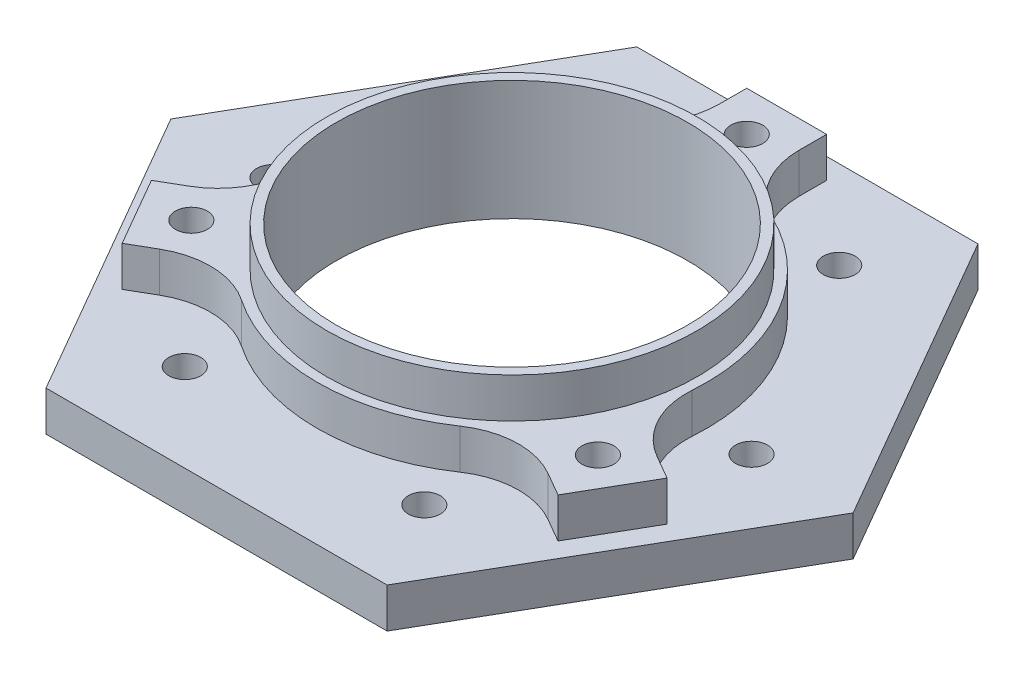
from build123d import *

# Parameters (mm, degrees)
SKETCH_1_R      = 22
SKETCH_1_R_2    = 2
EXTRUDE_1_DEPTH = 5
SKETCH_3_R      = 24.4
SKETCH_3_R_2    = 22
EXTRUDE_2_DEPTH = 5
SKETCH_4_R      = 23.2
SKETCH_4_R_2    = 22
EXTRUDE_3_DEPTH = 5
SKETCH_5_R      = 2
EXTRUDE_4_DEPTH = 5
FILLET_1_R      = 10


with BuildPart() as part:
    # Sketch 1 → Extrude 1 (new body)
    with BuildSketch(Plane(origin=(0, 0, 0), x_dir=(1, 0, 0), z_dir=(0, 1, 0))):
        Polygon((42.72391992, 0), (21.36195996, 37), (-21.36195996, 37), (-42.72391992, 0), (-21.36195996, -37), (21.36195996, -37), align=None)
        with Locations(Location((0, 0, 0), (0, 0, 270))):
            Circle(SKETCH_1_R, mode=Mode.SUBTRACT)
        with Locations(Location((15, 25.980762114, 0), (0, 0, 270))):
            Circle(SKETCH_1_R_2, mode=Mode.SUBTRACT)
        with Locations(Location((30, 0, 0), (0, 0, 270))):
            Circle(SKETCH_1_R_2, mode=Mode.SUBTRACT)
        with Locations(Location((15, -25.980762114, 0), (0, 0, 270))):
            Circle(SKETCH_1_R_2, mode=Mode.SUBTRACT)
        with Locations(Location((-15, -25.980762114, 0), (0, 0, 270))):
            Circle(SKETCH_1_R_2, mode=Mode.SUBTRACT)
        with Locations(Location((-30, 0, 0), (0, 0, 270))):
            Circle(SKETCH_1_R_2, mode=Mode.SUBTRACT)
        with Locations(Location((-15, 25.980762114, 0), (0, 0, 270))):
            Circle(SKETCH_1_R_2, mode=Mode.SUBTRACT)
    extrude(amount=EXTRUDE_1_DEPTH)

    # Sketch 3 → Extrude 2 (add)
    with BuildSketch(Plane(origin=(0, 5, 0), x_dir=(1, 0, 0), z_dir=(0, 1, 0))):
        with Locations(Location((0, 0, 0), (0, 0, 270))):
            Circle(SKETCH_3_R)
        with Locations(Location((0, 0, 0), (0, 0, 270))):
            Circle(SKETCH_3_R_2, mode=Mode.SUBTRACT)
    extrude(amount=EXTRUDE_2_DEPTH)

    # Sketch 4 → Extrude 3 (add)
    with BuildSketch(Plane(origin=(0, 10, 0), x_dir=(1, 0, 0), z_dir=(0, 1, 0))):
        with Locations(Location((0, 0, 0), (0, 0, 270))):
            Circle(SKETCH_4_R)
        with Locations(Location((0, 0, 0), (0, 0, 270))):
            Circle(SKETCH_4_R_2, mode=Mode.SUBTRACT)
    extrude(amount=EXTRUDE_3_DEPTH)

    # Sketch 5 → Extrude 4 (add)
    # profile 1 of 3: a face of its own
    with BuildSketch(Plane(origin=(0, 5, 0), x_dir=(1, 0, 0), z_dir=(0, 1, 0))):
        with BuildLine():
            Line((32.29127389, -12.869872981), (23.182601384, -7.610978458))
            ThreePointArc((23.182601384, -7.610978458), (21.131019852, -12.2), (18.182601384, -16.271232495))
            Line((18.182601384, -16.271232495), (27.29127389, -21.530127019))
            Line((27.29127389, -21.530127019), (32.29127389, -12.869872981))
        make_face()
        with Locations(Location((25.461146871, -14.7, 0), (0, 0, 270))):
            Circle(SKETCH_5_R, mode=Mode.SUBTRACT)
    # profile 2 of 3: a face of its own
    with BuildSketch(Plane(origin=(0, 5, 0), x_dir=(1, 0, 0), z_dir=(0, 1, 0))):
        with BuildLine():
            Line((-5, 34.4), (5, 34.4))
            Line((5, 34.4), (5, 23.882210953))
            ThreePointArc((5, 23.882210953), (0, 24.4), (-5, 23.882210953))
            Line((-5, 23.882210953), (-5, 34.4))
        make_face()
        with Locations(Location((0, 29.4, 0), (0, 0, 270))):
            Circle(SKETCH_5_R, mode=Mode.SUBTRACT)
    # profile 3 of 3: a face of its own
    with BuildSketch(Plane(origin=(0, 5, 0), x_dir=(1, 0, 0), z_dir=(0, 1, 0))):
        with BuildLine():
            Line((-27.29127389, -21.530127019), (-18.182601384, -16.271232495))
            ThreePointArc((-18.182601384, -16.271232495), (-21.131019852, -12.2), (-23.182601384, -7.610978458))
            Line((-23.182601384, -7.610978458), (-32.29127389, -12.869872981))
            Line((-32.29127389, -12.869872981), (-27.29127389, -21.530127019))
        make_face()
        with Locations(Location((-25.461146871, -14.7, 0), (0, 0, 270))):
            Circle(SKETCH_5_R, mode=Mode.SUBTRACT)
    extrude(amount=EXTRUDE_4_DEPTH)

    # Fillet 1
    fillet_1_edges = [part.edges().sort_by_distance(p)[0] for p in [
        (5, 7.5, -23.882210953),
        (-5, 7.5, -23.882210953),
        (18.182601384, 7.5, 16.271232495),
        (23.182601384, 7.5, 7.610978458),
        (-23.182601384, 7.5, 7.610978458),
        (-18.182601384, 7.5, 16.271232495),
    ]]
    fillet(fillet_1_edges, radius=FILLET_1_R)


solid = part.part
